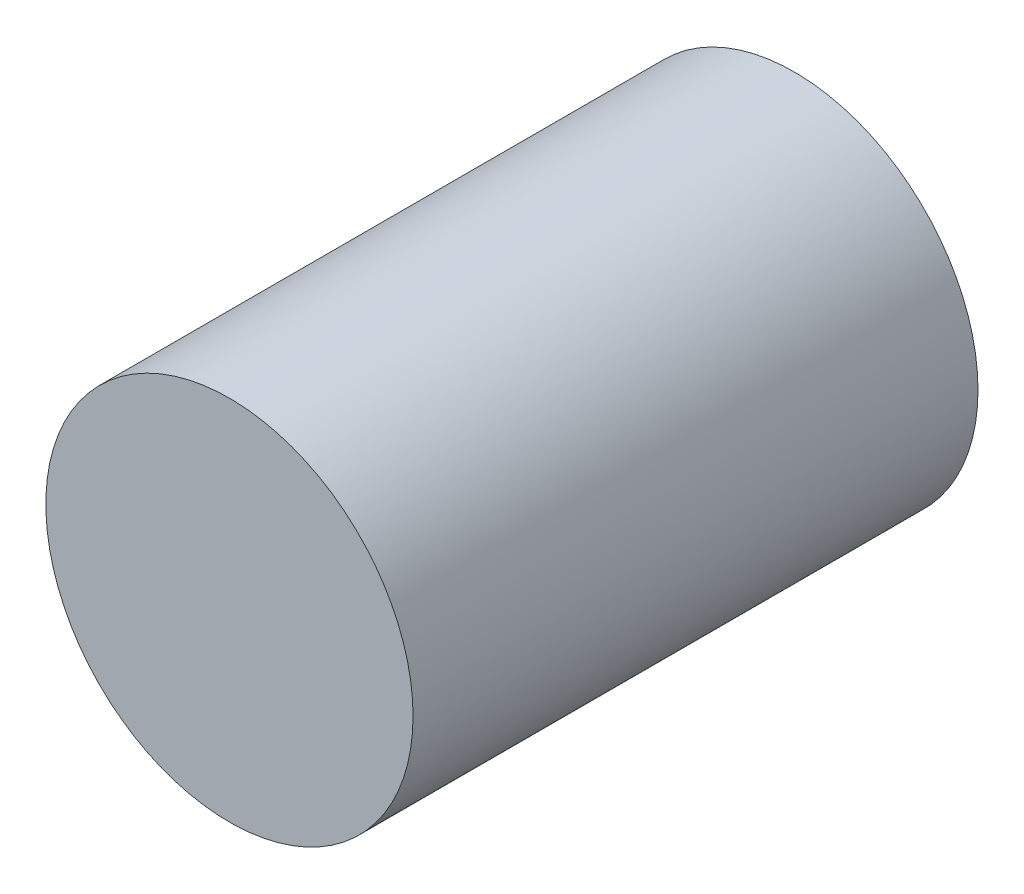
ISO-10303-21;
HEADER;
FILE_DESCRIPTION(('STEP AP214'),'2;1');
FILE_NAME('part.step','',(''),(''),'','','');
FILE_SCHEMA(('AUTOMOTIVE_DESIGN { 1 0 10303 214 1 1 1 1 }'));
ENDSEC;
DATA;
#1=APPLICATION_CONTEXT('core data for automotive mechanical design processes');
#2=APPLICATION_PROTOCOL_DEFINITION('international standard','automotive_design',2000,#1);
#3=PRODUCT_CONTEXT('',#1,'mechanical');
#4=PRODUCT('Part','Part','',(#3));
#5=PRODUCT_RELATED_PRODUCT_CATEGORY('part','',(#4));
#6=PRODUCT_DEFINITION_FORMATION('','',#4);
#7=PRODUCT_DEFINITION_CONTEXT('part definition',#1,'design');
#8=PRODUCT_DEFINITION('design','',#6,#7);
#9=PRODUCT_DEFINITION_SHAPE('','',#8);
#10=(LENGTH_UNIT() NAMED_UNIT(*) SI_UNIT(.MILLI.,.METRE.));
#11=(NAMED_UNIT(*) PLANE_ANGLE_UNIT() SI_UNIT($,.RADIAN.));
#12=(NAMED_UNIT(*) SI_UNIT($,.STERADIAN.) SOLID_ANGLE_UNIT());
#13=UNCERTAINTY_MEASURE_WITH_UNIT(LENGTH_MEASURE(1.E-05),#10,'distance_accuracy_value','');
#14=(GEOMETRIC_REPRESENTATION_CONTEXT(3) GLOBAL_UNCERTAINTY_ASSIGNED_CONTEXT((#13)) GLOBAL_UNIT_ASSIGNED_CONTEXT((#10,
#11,#12)) REPRESENTATION_CONTEXT('',''));
#15=CARTESIAN_POINT('',(0.,0.,0.));
#16=DIRECTION('',(0.,0.,1.));
#17=DIRECTION('',(1.,0.,0.));
#18=AXIS2_PLACEMENT_3D('',#15,#16,#17);
#19=CARTESIAN_POINT('',(0.,0.,1.00000054));
#20=DIRECTION('',(0.,0.,1.));
#21=DIRECTION('',(1.,0.,0.));
#22=AXIS2_PLACEMENT_3D('',#19,#20,#21);
#23=PLANE('',#22);
#24=CARTESIAN_POINT('',(0.,0.,1.00000054));
#25=DIRECTION('',(0.,0.,1.));
#26=DIRECTION('',(1.,0.,0.));
#27=AXIS2_PLACEMENT_3D('',#24,#25,#26);
#28=CIRCLE('',#27,0.32500062);
#29=CARTESIAN_POINT('',(0.32500062,0.,1.00000054));
#30=VERTEX_POINT('',#29);
#31=EDGE_CURVE('E11',#30,#30,#28,.T.);
#32=ORIENTED_EDGE('',*,*,#31,.T.);
#33=EDGE_LOOP('',(#32));
#34=FACE_BOUND('',#33,.T.);
#35=ADVANCED_FACE('F17',(#34),#23,.T.);
#36=CARTESIAN_POINT('',(0.,0.,0.));
#37=DIRECTION('',(0.,0.,1.));
#38=DIRECTION('',(1.,0.,0.));
#39=AXIS2_PLACEMENT_3D('',#36,#37,#38);
#40=PLANE('',#39);
#41=CARTESIAN_POINT('',(0.,0.,0.));
#42=DIRECTION('',(0.,0.,1.));
#43=DIRECTION('',(1.,0.,0.));
#44=AXIS2_PLACEMENT_3D('',#41,#42,#43);
#45=CIRCLE('',#44,0.32500062);
#46=CARTESIAN_POINT('',(0.32500062,0.,0.));
#47=VERTEX_POINT('',#46);
#48=EDGE_CURVE('E42',#47,#47,#45,.T.);
#49=ORIENTED_EDGE('',*,*,#48,.F.);
#50=EDGE_LOOP('',(#49));
#51=FACE_BOUND('',#50,.T.);
#52=ADVANCED_FACE('F64',(#51),#40,.F.);
#53=CARTESIAN_POINT('',(0.,0.,0.));
#54=DIRECTION('',(0.,0.,-1.));
#55=DIRECTION('',(1.,0.,0.));
#56=AXIS2_PLACEMENT_3D('',#53,#54,#55);
#57=CYLINDRICAL_SURFACE('',#56,0.32500062);
#58=ORIENTED_EDGE('',*,*,#48,.T.);
#59=DIRECTION('',(0.,0.,1.));
#60=VECTOR('',#59,1.);
#61=CARTESIAN_POINT('',(0.32500062,0.,0.));
#62=LINE('',#61,#60);
#63=EDGE_CURVE('E25',#47,#30,#62,.T.);
#64=ORIENTED_EDGE('',*,*,#63,.T.);
#65=ORIENTED_EDGE('',*,*,#31,.F.);
#66=ORIENTED_EDGE('',*,*,#63,.F.);
#67=EDGE_LOOP('',(#58,#64,#65,#66));
#68=FACE_BOUND('',#67,.T.);
#69=ADVANCED_FACE('F40',(#68),#57,.T.);
#70=CLOSED_SHELL('',(#35,#52,#69));
#71=MANIFOLD_SOLID_BREP('B1',#70);
#72=ADVANCED_BREP_SHAPE_REPRESENTATION('',(#18,#71),#14);
#73=SHAPE_DEFINITION_REPRESENTATION(#9,#72);
ENDSEC;
END-ISO-10303-21;
